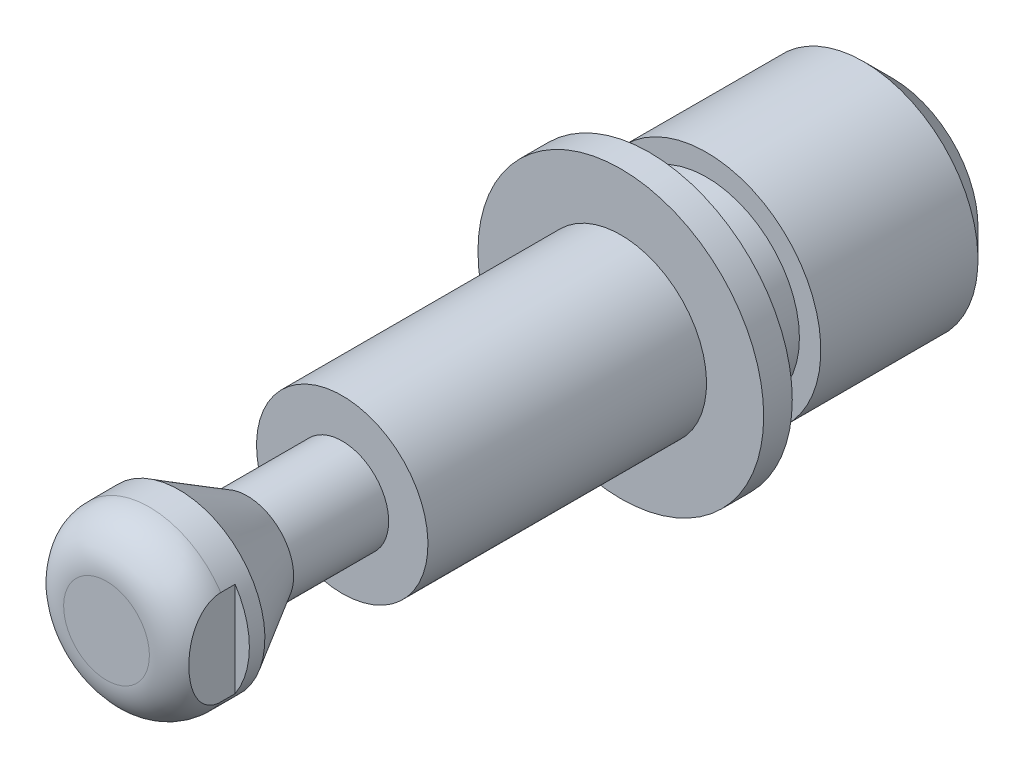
ISO-10303-21;
HEADER;
FILE_DESCRIPTION(('STEP AP214'),'2;1');
FILE_NAME('part.step','',(''),(''),'','','');
FILE_SCHEMA(('AUTOMOTIVE_DESIGN { 1 0 10303 214 1 1 1 1 }'));
ENDSEC;
DATA;
#1=APPLICATION_CONTEXT('core data for automotive mechanical design processes');
#2=APPLICATION_PROTOCOL_DEFINITION('international standard','automotive_design',2000,#1);
#3=PRODUCT_CONTEXT('',#1,'mechanical');
#4=PRODUCT('Part','Part','',(#3));
#5=PRODUCT_RELATED_PRODUCT_CATEGORY('part','',(#4));
#6=PRODUCT_DEFINITION_FORMATION('','',#4);
#7=PRODUCT_DEFINITION_CONTEXT('part definition',#1,'design');
#8=PRODUCT_DEFINITION('design','',#6,#7);
#9=PRODUCT_DEFINITION_SHAPE('','',#8);
#10=(LENGTH_UNIT() NAMED_UNIT(*) SI_UNIT(.MILLI.,.METRE.));
#11=(NAMED_UNIT(*) PLANE_ANGLE_UNIT() SI_UNIT($,.RADIAN.));
#12=(NAMED_UNIT(*) SI_UNIT($,.STERADIAN.) SOLID_ANGLE_UNIT());
#13=UNCERTAINTY_MEASURE_WITH_UNIT(LENGTH_MEASURE(1.E-05),#10,'distance_accuracy_value','');
#14=(GEOMETRIC_REPRESENTATION_CONTEXT(3) GLOBAL_UNCERTAINTY_ASSIGNED_CONTEXT((#13)) GLOBAL_UNIT_ASSIGNED_CONTEXT((#10,
#11,#12)) REPRESENTATION_CONTEXT('',''));
#15=CARTESIAN_POINT('',(0.,0.,0.));
#16=DIRECTION('',(0.,0.,1.));
#17=DIRECTION('',(1.,0.,0.));
#18=AXIS2_PLACEMENT_3D('',#15,#16,#17);
#19=CARTESIAN_POINT('',(0.,0.,0.));
#20=DIRECTION('',(0.,0.,-1.));
#21=DIRECTION('',(0.,1.,0.));
#22=AXIS2_PLACEMENT_3D('',#19,#20,#21);
#23=PLANE('',#22);
#24=CARTESIAN_POINT('',(0.,0.,0.));
#25=DIRECTION('',(0.,0.,1.));
#26=DIRECTION('',(0.,-1.,0.));
#27=AXIS2_PLACEMENT_3D('',#24,#25,#26);
#28=CIRCLE('',#27,10.);
#29=CARTESIAN_POINT('',(0.,-10.,0.));
#30=VERTEX_POINT('',#29);
#31=EDGE_CURVE('E107',#30,#30,#28,.T.);
#32=ORIENTED_EDGE('',*,*,#31,.F.);
#33=EDGE_LOOP('',(#32));
#34=FACE_BOUND('',#33,.T.);
#35=CARTESIAN_POINT('',(0.,0.,0.));
#36=DIRECTION('',(0.,0.,-1.));
#37=DIRECTION('',(1.,0.,0.));
#38=AXIS2_PLACEMENT_3D('',#35,#36,#37);
#39=CIRCLE('',#38,6.5);
#40=CARTESIAN_POINT('',(6.5,0.,0.));
#41=VERTEX_POINT('',#40);
#42=EDGE_CURVE('E82',#41,#41,#39,.T.);
#43=ORIENTED_EDGE('',*,*,#42,.F.);
#44=EDGE_LOOP('',(#43));
#45=FACE_BOUND('',#44,.T.);
#46=ADVANCED_FACE('F14',(#34,#45),#23,.T.);
#47=CARTESIAN_POINT('',(0.,0.,0.));
#48=DIRECTION('',(0.,0.,1.));
#49=DIRECTION('',(0.,-1.,0.));
#50=AXIS2_PLACEMENT_3D('',#47,#48,#49);
#51=CYLINDRICAL_SURFACE('',#50,10.);
#52=ORIENTED_EDGE('',*,*,#31,.T.);
#53=EDGE_LOOP('',(#52));
#54=FACE_BOUND('',#53,.T.);
#55=CARTESIAN_POINT('',(0.,0.,2.));
#56=DIRECTION('',(0.,0.,1.));
#57=DIRECTION('',(0.,-1.,0.));
#58=AXIS2_PLACEMENT_3D('',#55,#56,#57);
#59=CIRCLE('',#58,10.);
#60=CARTESIAN_POINT('',(0.,-10.,2.));
#61=VERTEX_POINT('',#60);
#62=EDGE_CURVE('E104',#61,#61,#59,.T.);
#63=ORIENTED_EDGE('',*,*,#62,.F.);
#64=EDGE_LOOP('',(#63));
#65=FACE_BOUND('',#64,.T.);
#66=ADVANCED_FACE('F157',(#54,#65),#51,.T.);
#67=CARTESIAN_POINT('',(0.,-10.,2.));
#68=DIRECTION('',(0.,0.,1.));
#69=DIRECTION('',(0.,-1.,0.));
#70=AXIS2_PLACEMENT_3D('',#67,#68,#69);
#71=PLANE('',#70);
#72=ORIENTED_EDGE('',*,*,#62,.T.);
#73=EDGE_LOOP('',(#72));
#74=FACE_BOUND('',#73,.T.);
#75=CARTESIAN_POINT('',(0.,0.,2.));
#76=DIRECTION('',(0.,0.,1.));
#77=DIRECTION('',(0.,-1.,0.));
#78=AXIS2_PLACEMENT_3D('',#75,#76,#77);
#79=CIRCLE('',#78,6.);
#80=CARTESIAN_POINT('',(0.,-6.,2.));
#81=VERTEX_POINT('',#80);
#82=EDGE_CURVE('E101',#81,#81,#79,.T.);
#83=ORIENTED_EDGE('',*,*,#82,.F.);
#84=EDGE_LOOP('',(#83));
#85=FACE_BOUND('',#84,.T.);
#86=ADVANCED_FACE('F163',(#74,#85),#71,.T.);
#87=CARTESIAN_POINT('',(0.,0.,0.));
#88=DIRECTION('',(0.,0.,1.));
#89=DIRECTION('',(0.,-1.,0.));
#90=AXIS2_PLACEMENT_3D('',#87,#88,#89);
#91=CYLINDRICAL_SURFACE('',#90,6.);
#92=ORIENTED_EDGE('',*,*,#82,.T.);
#93=EDGE_LOOP('',(#92));
#94=FACE_BOUND('',#93,.T.);
#95=CARTESIAN_POINT('',(0.,0.,21.5));
#96=DIRECTION('',(0.,0.,1.));
#97=DIRECTION('',(0.,-1.,0.));
#98=AXIS2_PLACEMENT_3D('',#95,#96,#97);
#99=CIRCLE('',#98,6.);
#100=CARTESIAN_POINT('',(0.,-6.,21.5));
#101=VERTEX_POINT('',#100);
#102=EDGE_CURVE('E98',#101,#101,#99,.T.);
#103=ORIENTED_EDGE('',*,*,#102,.F.);
#104=EDGE_LOOP('',(#103));
#105=FACE_BOUND('',#104,.T.);
#106=ADVANCED_FACE('F171',(#94,#105),#91,.T.);
#107=CARTESIAN_POINT('',(0.,-3.25,21.5));
#108=DIRECTION('',(0.,0.,1.));
#109=DIRECTION('',(0.,-1.,0.));
#110=AXIS2_PLACEMENT_3D('',#107,#108,#109);
#111=PLANE('',#110);
#112=ORIENTED_EDGE('',*,*,#102,.T.);
#113=EDGE_LOOP('',(#112));
#114=FACE_BOUND('',#113,.T.);
#115=CARTESIAN_POINT('',(0.,0.,21.5));
#116=DIRECTION('',(0.,0.,1.));
#117=DIRECTION('',(0.,-1.,0.));
#118=AXIS2_PLACEMENT_3D('',#115,#116,#117);
#119=CIRCLE('',#118,3.25);
#120=CARTESIAN_POINT('',(0.,-3.25,21.5));
#121=VERTEX_POINT('',#120);
#122=EDGE_CURVE('E95',#121,#121,#119,.T.);
#123=ORIENTED_EDGE('',*,*,#122,.F.);
#124=EDGE_LOOP('',(#123));
#125=FACE_BOUND('',#124,.T.);
#126=ADVANCED_FACE('F175',(#114,#125),#111,.T.);
#127=CARTESIAN_POINT('',(0.,0.,0.));
#128=DIRECTION('',(0.,0.,1.));
#129=DIRECTION('',(0.,-1.,0.));
#130=AXIS2_PLACEMENT_3D('',#127,#128,#129);
#131=CYLINDRICAL_SURFACE('',#130,3.25);
#132=ORIENTED_EDGE('',*,*,#122,.T.);
#133=EDGE_LOOP('',(#132));
#134=FACE_BOUND('',#133,.T.);
#135=CARTESIAN_POINT('',(0.,0.,28.15));
#136=DIRECTION('',(0.,0.,1.));
#137=DIRECTION('',(0.,-1.,0.));
#138=AXIS2_PLACEMENT_3D('',#135,#136,#137);
#139=CIRCLE('',#138,3.25);
#140=CARTESIAN_POINT('',(0.,-3.25,28.15));
#141=VERTEX_POINT('',#140);
#142=EDGE_CURVE('E92',#141,#141,#139,.T.);
#143=ORIENTED_EDGE('',*,*,#142,.F.);
#144=EDGE_LOOP('',(#143));
#145=FACE_BOUND('',#144,.T.);
#146=ADVANCED_FACE('F179',(#134,#145),#131,.T.);
#147=CARTESIAN_POINT('',(0.,0.,32.9131397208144));
#148=DIRECTION('',(0.,0.,1.));
#149=DIRECTION('',(0.,-1.,0.));
#150=AXIS2_PLACEMENT_3D('',#147,#148,#149);
#151=CONICAL_SURFACE('',#150,6.,0.5235987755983);
#152=ORIENTED_EDGE('',*,*,#142,.T.);
#153=EDGE_LOOP('',(#152));
#154=FACE_BOUND('',#153,.T.);
#155=CARTESIAN_POINT('',(0.,0.,32.9131397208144));
#156=DIRECTION('',(0.,0.,1.));
#157=DIRECTION('',(0.,-1.,0.));
#158=AXIS2_PLACEMENT_3D('',#155,#156,#157);
#159=CIRCLE('',#158,6.);
#160=CARTESIAN_POINT('',(0.,-6.,32.9131397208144));
#161=VERTEX_POINT('',#160);
#162=EDGE_CURVE('E89',#161,#161,#159,.T.);
#163=ORIENTED_EDGE('',*,*,#162,.F.);
#164=EDGE_LOOP('',(#163));
#165=FACE_BOUND('',#164,.T.);
#166=ADVANCED_FACE('F183',(#154,#165),#151,.T.);
#167=CARTESIAN_POINT('',(0.,0.,0.));
#168=DIRECTION('',(0.,0.,1.));
#169=DIRECTION('',(0.,-1.,0.));
#170=AXIS2_PLACEMENT_3D('',#167,#168,#169);
#171=CYLINDRICAL_SURFACE('',#170,6.);
#172=DIRECTION('',(0.,0.,1.));
#173=VECTOR('',#172,1.);
#174=CARTESIAN_POINT('',(5.,-3.31662479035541,0.));
#175=LINE('',#174,#173);
#176=CARTESIAN_POINT('',(5.,-3.31662479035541,35.));
#177=VERTEX_POINT('',#176);
#178=CARTESIAN_POINT('',(5.,-3.31662479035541,34.));
#179=VERTEX_POINT('',#178);
#180=EDGE_CURVE('E64',#177,#179,#175,.F.);
#181=ORIENTED_EDGE('',*,*,#180,.F.);
#182=CARTESIAN_POINT('',(0.,0.,35.));
#183=DIRECTION('',(0.,0.,1.));
#184=DIRECTION('',(0.,-1.,0.));
#185=AXIS2_PLACEMENT_3D('',#182,#183,#184);
#186=CIRCLE('',#185,6.);
#187=CARTESIAN_POINT('',(-5.,-3.31662479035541,35.));
#188=VERTEX_POINT('',#187);
#189=EDGE_CURVE('E37',#177,#188,#186,.F.);
#190=ORIENTED_EDGE('',*,*,#189,.T.);
#191=DIRECTION('',(0.,0.,1.));
#192=VECTOR('',#191,1.);
#193=CARTESIAN_POINT('',(-5.,-3.31662479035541,0.));
#194=LINE('',#193,#192);
#195=CARTESIAN_POINT('',(-5.,-3.31662479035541,34.));
#196=VERTEX_POINT('',#195);
#197=EDGE_CURVE('E78',#196,#188,#194,.T.);
#198=ORIENTED_EDGE('',*,*,#197,.F.);
#199=CARTESIAN_POINT('',(0.,0.,34.));
#200=DIRECTION('',(0.,0.,-1.));
#201=DIRECTION('',(1.,0.,0.));
#202=AXIS2_PLACEMENT_3D('',#199,#200,#201);
#203=CIRCLE('',#202,6.);
#204=CARTESIAN_POINT('',(-5.,3.31662479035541,34.));
#205=VERTEX_POINT('',#204);
#206=EDGE_CURVE('E123',#205,#196,#203,.F.);
#207=ORIENTED_EDGE('',*,*,#206,.F.);
#208=DIRECTION('',(0.,0.,1.));
#209=VECTOR('',#208,1.);
#210=CARTESIAN_POINT('',(-5.,3.31662479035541,0.));
#211=LINE('',#210,#209);
#212=CARTESIAN_POINT('',(-5.,3.31662479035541,35.));
#213=VERTEX_POINT('',#212);
#214=EDGE_CURVE('E80',#213,#205,#211,.F.);
#215=ORIENTED_EDGE('',*,*,#214,.F.);
#216=CARTESIAN_POINT('',(5.,3.31662479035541,35.));
#217=VERTEX_POINT('',#216);
#218=EDGE_CURVE('E71',#213,#217,#186,.F.);
#219=ORIENTED_EDGE('',*,*,#218,.T.);
#220=DIRECTION('',(0.,0.,1.));
#221=VECTOR('',#220,1.);
#222=CARTESIAN_POINT('',(5.,3.31662479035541,0.));
#223=LINE('',#222,#221);
#224=CARTESIAN_POINT('',(5.,3.31662479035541,34.));
#225=VERTEX_POINT('',#224);
#226=EDGE_CURVE('E29',#225,#217,#223,.T.);
#227=ORIENTED_EDGE('',*,*,#226,.F.);
#228=CARTESIAN_POINT('',(0.,0.,34.));
#229=DIRECTION('',(0.,0.,-1.));
#230=DIRECTION('',(1.,0.,0.));
#231=AXIS2_PLACEMENT_3D('',#228,#229,#230);
#232=CIRCLE('',#231,6.);
#233=EDGE_CURVE('E58',#179,#225,#232,.F.);
#234=ORIENTED_EDGE('',*,*,#233,.F.);
#235=EDGE_LOOP('',(#181,#190,#198,#207,#215,#219,#227,#234));
#236=FACE_BOUND('',#235,.T.);
#237=ORIENTED_EDGE('',*,*,#162,.T.);
#238=EDGE_LOOP('',(#237));
#239=FACE_BOUND('',#238,.T.);
#240=ADVANCED_FACE('F67',(#236,#239),#171,.T.);
#241=CARTESIAN_POINT('',(0.,0.,38.));
#242=DIRECTION('',(0.,0.,1.));
#243=DIRECTION('',(0.,-1.,0.));
#244=AXIS2_PLACEMENT_3D('',#241,#242,#243);
#245=PLANE('',#244);
#246=CARTESIAN_POINT('',(0.,0.,38.));
#247=DIRECTION('',(0.,0.,1.));
#248=DIRECTION('',(0.,-1.,0.));
#249=AXIS2_PLACEMENT_3D('',#246,#247,#248);
#250=CIRCLE('',#249,3.);
#251=CARTESIAN_POINT('',(0.,-3.,38.));
#252=VERTEX_POINT('',#251);
#253=EDGE_CURVE('E110',#252,#252,#250,.T.);
#254=ORIENTED_EDGE('',*,*,#253,.T.);
#255=EDGE_LOOP('',(#254));
#256=FACE_BOUND('',#255,.T.);
#257=ADVANCED_FACE('F189',(#256),#245,.T.);
#258=CARTESIAN_POINT('',(0.,0.,35.));
#259=DIRECTION('',(0.,0.,1.));
#260=DIRECTION('',(0.,-1.,0.));
#261=AXIS2_PLACEMENT_3D('',#258,#259,#260);
#262=DEGENERATE_TOROIDAL_SURFACE('',#261,3.,3.,.T.);
#263=CARTESIAN_POINT('',(5.,0.,37.2360679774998));
#264=CARTESIAN_POINT('',(5.,-0.120918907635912,37.2360654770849));
#265=CARTESIAN_POINT('',(5.,-0.241827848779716,37.2321569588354));
#266=CARTESIAN_POINT('',(5.,-0.483117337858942,37.2163673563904));
#267=CARTESIAN_POINT('',(5.,-0.603497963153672,37.204487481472));
#268=CARTESIAN_POINT('',(5.,-0.843175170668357,37.172309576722));
#269=CARTESIAN_POINT('',(5.,-0.962471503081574,37.1520096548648));
#270=CARTESIAN_POINT('',(5.,-1.19911813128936,37.1022831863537));
#271=CARTESIAN_POINT('',(5.,-1.31646901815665,37.0728594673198));
#272=CARTESIAN_POINT('',(5.,-1.59010251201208,36.9914925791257));
#273=CARTESIAN_POINT('',(5.,-1.74515200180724,36.9352545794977));
#274=CARTESIAN_POINT('',(5.,-2.0457254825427,36.8013699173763));
#275=CARTESIAN_POINT('',(5.,-2.19126336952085,36.7237553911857));
#276=CARTESIAN_POINT('',(5.,-2.43890308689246,36.5627711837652));
#277=CARTESIAN_POINT('',(5.,-2.54382254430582,36.4837739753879));
#278=CARTESIAN_POINT('',(5.,-2.7396282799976,36.3098769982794));
#279=CARTESIAN_POINT('',(5.,-2.83053188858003,36.214997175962));
#280=CARTESIAN_POINT('',(5.,-2.97723052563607,36.0301159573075));
#281=CARTESIAN_POINT('',(5.,-3.03641451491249,35.942813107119));
#282=CARTESIAN_POINT('',(5.,-3.13957828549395,35.7595839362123));
#283=CARTESIAN_POINT('',(5.,-3.18356514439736,35.6636616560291));
#284=CARTESIAN_POINT('',(5.,-3.25393965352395,35.4648474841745));
#285=CARTESIAN_POINT('',(5.,-3.28022077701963,35.3619174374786));
#286=CARTESIAN_POINT('',(5.,-3.31290834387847,35.1529411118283));
#287=CARTESIAN_POINT('',(5.,-3.31932342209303,35.0468962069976));
#288=CARTESIAN_POINT('',(5.,-3.31222176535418,34.8462659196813));
#289=CARTESIAN_POINT('',(5.,-3.30065386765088,34.7516055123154));
#290=CARTESIAN_POINT('',(5.,-3.26181910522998,34.5655953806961));
#291=CARTESIAN_POINT('',(5.,-3.23455371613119,34.4742453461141));
#292=CARTESIAN_POINT('',(5.,-3.16568011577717,34.2967666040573));
#293=CARTESIAN_POINT('',(5.,-3.12401645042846,34.2106596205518));
#294=CARTESIAN_POINT('',(5.,-3.02836892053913,34.0456244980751));
#295=CARTESIAN_POINT('',(5.,-2.97437928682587,33.9666997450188));
#296=CARTESIAN_POINT('',(5.,-2.83319578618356,33.7878200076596));
#297=CARTESIAN_POINT('',(5.,-2.74125094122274,33.6916074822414));
#298=CARTESIAN_POINT('',(5.,-2.54296994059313,33.5154254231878));
#299=CARTESIAN_POINT('',(5.,-2.43660860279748,33.4354849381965));
#300=CARTESIAN_POINT('',(5.,-2.16830650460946,33.2616870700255));
#301=CARTESIAN_POINT('',(5.,-2.00142235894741,33.1755042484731));
#302=CARTESIAN_POINT('',(5.,-1.65626349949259,33.0302057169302));
#303=CARTESIAN_POINT('',(5.,-1.47796334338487,32.9711530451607));
#304=CARTESIAN_POINT('',(5.,-1.15914275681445,32.8876929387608));
#305=CARTESIAN_POINT('',(5.,-1.01985771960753,32.8583678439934));
#306=CARTESIAN_POINT('',(5.,-0.739223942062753,32.8117236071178));
#307=CARTESIAN_POINT('',(5.,-0.597874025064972,32.7944116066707));
#308=CARTESIAN_POINT('',(5.,-0.314037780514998,32.7709143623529));
#309=CARTESIAN_POINT('',(5.,-0.171549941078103,32.7647478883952));
#310=CARTESIAN_POINT('',(5.,0.113440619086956,32.7632671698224));
#311=CARTESIAN_POINT('',(5.,0.255943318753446,32.7679492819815));
#312=CARTESIAN_POINT('',(5.,0.518018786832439,32.7868218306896));
#313=CARTESIAN_POINT('',(5.,0.637707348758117,32.7994184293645));
#314=CARTESIAN_POINT('',(5.,0.875936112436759,32.8330000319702));
#315=CARTESIAN_POINT('',(5.,0.994476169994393,32.8539860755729));
#316=CARTESIAN_POINT('',(5.,1.22924960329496,32.9049977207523));
#317=CARTESIAN_POINT('',(5.,1.34548886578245,32.9349958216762));
#318=CARTESIAN_POINT('',(5.,1.57487815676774,33.0049676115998));
#319=CARTESIAN_POINT('',(5.,1.68802992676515,33.0449355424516));
#320=CARTESIAN_POINT('',(5.,1.93726711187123,33.1471729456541));
#321=CARTESIAN_POINT('',(5.,2.07212579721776,33.2125115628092));
#322=CARTESIAN_POINT('',(5.,2.33077391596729,33.3624490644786));
#323=CARTESIAN_POINT('',(5.,2.45457463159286,33.4470279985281));
#324=CARTESIAN_POINT('',(5.,2.66253632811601,33.6179675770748));
#325=CARTESIAN_POINT('',(5.,2.74969244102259,33.7006594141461));
#326=CARTESIAN_POINT('',(5.,2.90941931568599,33.8791550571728));
#327=CARTESIAN_POINT('',(5.,2.98200679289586,33.9749436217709));
#328=CARTESIAN_POINT('',(5.,3.0982354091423,34.1618145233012));
#329=CARTESIAN_POINT('',(5.,3.14465751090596,34.2511615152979));
#330=CARTESIAN_POINT('',(5.,3.22195881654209,34.4363821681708));
#331=CARTESIAN_POINT('',(5.,3.25284467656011,34.5322530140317));
#332=CARTESIAN_POINT('',(5.,3.29731276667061,34.7283734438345));
#333=CARTESIAN_POINT('',(5.,3.31082509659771,34.8286390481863));
#334=CARTESIAN_POINT('',(5.,3.31940920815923,35.0299567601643));
#335=CARTESIAN_POINT('',(5.,3.31448404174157,35.1310087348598));
#336=CARTESIAN_POINT('',(5.,3.28751634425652,35.3236265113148));
#337=CARTESIAN_POINT('',(5.,3.26668052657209,35.4153652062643));
#338=CARTESIAN_POINT('',(5.,3.21051142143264,35.5942547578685));
#339=CARTESIAN_POINT('',(5.,3.17517729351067,35.6814053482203));
#340=CARTESIAN_POINT('',(5.,3.08996682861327,35.8529027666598));
#341=CARTESIAN_POINT('',(5.,3.03953428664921,35.9369712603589));
#342=CARTESIAN_POINT('',(5.,2.92708168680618,36.0969044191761));
#343=CARTESIAN_POINT('',(5.,2.86505640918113,36.1727653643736));
#344=CARTESIAN_POINT('',(5.,2.70091379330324,36.3486262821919));
#345=CARTESIAN_POINT('',(5.,2.59347912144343,36.4436767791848));
#346=CARTESIAN_POINT('',(5.,2.36468756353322,36.6152304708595));
#347=CARTESIAN_POINT('',(5.,2.24329783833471,36.6916885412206));
#348=CARTESIAN_POINT('',(5.,1.93419060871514,36.8581380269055));
#349=CARTESIAN_POINT('',(5.,1.74132926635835,36.9385798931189));
#350=CARTESIAN_POINT('',(5.,1.44490972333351,37.0360436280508));
#351=CARTESIAN_POINT('',(5.,1.34482286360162,37.0646801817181));
#352=CARTESIAN_POINT('',(5.,1.14288449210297,37.1148876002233));
#353=CARTESIAN_POINT('',(5.,1.04103334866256,37.1364599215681));
#354=CARTESIAN_POINT('',(5.,0.783859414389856,37.1824311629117));
#355=CARTESIAN_POINT('',(5.,0.62778968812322,37.2026484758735));
#356=CARTESIAN_POINT('',(5.,0.314474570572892,37.2294704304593));
#357=CARTESIAN_POINT('',(5.,0.15722885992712,37.2360712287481));
#358=CARTESIAN_POINT('',(5.,0.,37.2360679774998));
#359=B_SPLINE_CURVE_WITH_KNOTS('',3,(#263,#264,#265,#266,#267,#268,#269,#270,#271,#272,#273,
#274,#275,#276,#277,#278,#279,#280,#281,#282,#283,#284,#285,#286,#287,#288,#289,#290,#291,#292,
#293,#294,#295,#296,#297,#298,#299,#300,#301,#302,#303,#304,#305,#306,#307,#308,#309,#310,#311,
#312,#313,#314,#315,#316,#317,#318,#319,#320,#321,#322,#323,#324,#325,#326,#327,#328,#329,#330,
#331,#332,#333,#334,#335,#336,#337,#338,#339,#340,#341,#342,#343,#344,#345,#346,#347,#348,#349,
#350,#351,#352,#353,#354,#355,#356,#357,#358),.UNSPECIFIED.,.T.,.F.,(4,2,2,2,2,2,2,2,2,2,2,2,2,
2,2,2,2,2,2,2,2,2,2,2,2,2,2,2,2,2,2,2,2,2,2,2,2,2,2,2,2,2,2,2,2,2,2,4),(0.,0.362673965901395,
0.725292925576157,1.08799341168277,1.45058160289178,1.94401806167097,2.43671672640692,
2.8293214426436,3.22143674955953,3.53657847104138,3.85157322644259,4.16844661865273,
4.48518226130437,4.76990781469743,5.05460660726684,5.34041435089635,5.62635614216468,
6.02338925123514,6.4211250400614,6.98148877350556,7.54314803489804,7.96962891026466,
8.39636310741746,8.82381529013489,9.25112394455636,9.61190509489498,9.97273096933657,
10.332466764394,10.6919952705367,11.1401969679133,11.5879360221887,11.9470202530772,
12.3056901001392,12.6064755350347,12.9071319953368,13.2089943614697,13.5108067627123,
13.7917573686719,14.072724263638,14.3656805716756,14.6587691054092,15.0866864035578,
15.515632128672,16.1388153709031,16.4509640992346,16.7630484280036,17.2344943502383,
17.7060733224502),.UNSPECIFIED.);
#360=EDGE_CURVE('E61',#217,#177,#359,.T.);
#361=ORIENTED_EDGE('',*,*,#360,.F.);
#362=ORIENTED_EDGE('',*,*,#218,.F.);
#363=CARTESIAN_POINT('',(-5.,0.,37.2360679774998));
#364=CARTESIAN_POINT('',(-5.,0.12091890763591,37.2360654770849));
#365=CARTESIAN_POINT('',(-5.,0.241827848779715,37.2321569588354));
#366=CARTESIAN_POINT('',(-5.,0.483117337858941,37.2163673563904));
#367=CARTESIAN_POINT('',(-5.,0.603497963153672,37.204487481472));
#368=CARTESIAN_POINT('',(-5.,0.843175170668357,37.172309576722));
#369=CARTESIAN_POINT('',(-5.,0.962471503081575,37.1520096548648));
#370=CARTESIAN_POINT('',(-5.,1.19911813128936,37.1022831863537));
#371=CARTESIAN_POINT('',(-5.,1.31646901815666,37.0728594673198));
#372=CARTESIAN_POINT('',(-5.,1.59010251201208,36.9914925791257));
#373=CARTESIAN_POINT('',(-5.,1.74515200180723,36.9352545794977));
#374=CARTESIAN_POINT('',(-5.,2.0457254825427,36.8013699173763));
#375=CARTESIAN_POINT('',(-5.,2.19126336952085,36.7237553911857));
#376=CARTESIAN_POINT('',(-5.,2.43890308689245,36.5627711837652));
#377=CARTESIAN_POINT('',(-5.,2.54382254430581,36.4837739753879));
#378=CARTESIAN_POINT('',(-5.,2.73962827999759,36.3098769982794));
#379=CARTESIAN_POINT('',(-5.,2.83053188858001,36.214997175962));
#380=CARTESIAN_POINT('',(-5.,2.97723052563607,36.0301159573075));
#381=CARTESIAN_POINT('',(-5.,3.03641451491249,35.942813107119));
#382=CARTESIAN_POINT('',(-5.,3.13957828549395,35.7595839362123));
#383=CARTESIAN_POINT('',(-5.,3.18356514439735,35.6636616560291));
#384=CARTESIAN_POINT('',(-5.,3.25393965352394,35.4648474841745));
#385=CARTESIAN_POINT('',(-5.,3.28022077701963,35.3619174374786));
#386=CARTESIAN_POINT('',(-5.,3.31290834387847,35.1529411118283));
#387=CARTESIAN_POINT('',(-5.,3.31932342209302,35.0468962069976));
#388=CARTESIAN_POINT('',(-5.,3.31222176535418,34.8462659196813));
#389=CARTESIAN_POINT('',(-5.,3.30065386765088,34.7516055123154));
#390=CARTESIAN_POINT('',(-5.,3.26181910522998,34.5655953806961));
#391=CARTESIAN_POINT('',(-5.,3.23455371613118,34.4742453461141));
#392=CARTESIAN_POINT('',(-5.,3.16568011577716,34.2967666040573));
#393=CARTESIAN_POINT('',(-5.,3.12401645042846,34.2106596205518));
#394=CARTESIAN_POINT('',(-5.,3.02836892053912,34.0456244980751));
#395=CARTESIAN_POINT('',(-5.,2.97437928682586,33.9666997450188));
#396=CARTESIAN_POINT('',(-5.,2.83319578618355,33.7878200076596));
#397=CARTESIAN_POINT('',(-5.,2.74125094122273,33.6916074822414));
#398=CARTESIAN_POINT('',(-5.,2.54296994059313,33.5154254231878));
#399=CARTESIAN_POINT('',(-5.,2.43660860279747,33.4354849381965));
#400=CARTESIAN_POINT('',(-5.,2.16830650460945,33.2616870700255));
#401=CARTESIAN_POINT('',(-5.,2.0014223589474,33.1755042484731));
#402=CARTESIAN_POINT('',(-5.,1.65626349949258,33.0302057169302));
#403=CARTESIAN_POINT('',(-5.,1.47796334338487,32.9711530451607));
#404=CARTESIAN_POINT('',(-5.,1.15914275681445,32.8876929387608));
#405=CARTESIAN_POINT('',(-5.,1.01985771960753,32.8583678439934));
#406=CARTESIAN_POINT('',(-5.,0.739223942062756,32.8117236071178));
#407=CARTESIAN_POINT('',(-5.,0.597874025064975,32.7944116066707));
#408=CARTESIAN_POINT('',(-5.,0.314037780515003,32.7709143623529));
#409=CARTESIAN_POINT('',(-5.,0.17154994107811,32.7647478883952));
#410=CARTESIAN_POINT('',(-5.,-0.113440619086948,32.7632671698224));
#411=CARTESIAN_POINT('',(-5.,-0.255943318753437,32.7679492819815));
#412=CARTESIAN_POINT('',(-5.,-0.518018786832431,32.7868218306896));
#413=CARTESIAN_POINT('',(-5.,-0.63770734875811,32.7994184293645));
#414=CARTESIAN_POINT('',(-5.,-0.875936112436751,32.8330000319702));
#415=CARTESIAN_POINT('',(-5.,-0.994476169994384,32.8539860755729));
#416=CARTESIAN_POINT('',(-5.,-1.22924960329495,32.9049977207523));
#417=CARTESIAN_POINT('',(-5.,-1.34548886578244,32.9349958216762));
#418=CARTESIAN_POINT('',(-5.,-1.57487815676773,33.0049676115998));
#419=CARTESIAN_POINT('',(-5.,-1.68802992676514,33.0449355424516));
#420=CARTESIAN_POINT('',(-5.,-1.93726711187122,33.1471729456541));
#421=CARTESIAN_POINT('',(-5.,-2.07212579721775,33.2125115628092));
#422=CARTESIAN_POINT('',(-5.,-2.33077391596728,33.3624490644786));
#423=CARTESIAN_POINT('',(-5.,-2.45457463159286,33.4470279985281));
#424=CARTESIAN_POINT('',(-5.,-2.66253632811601,33.6179675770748));
#425=CARTESIAN_POINT('',(-5.,-2.74969244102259,33.7006594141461));
#426=CARTESIAN_POINT('',(-5.,-2.90941931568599,33.8791550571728));
#427=CARTESIAN_POINT('',(-5.,-2.98200679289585,33.9749436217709));
#428=CARTESIAN_POINT('',(-5.,-3.0982354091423,34.1618145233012));
#429=CARTESIAN_POINT('',(-5.,-3.14465751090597,34.2511615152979));
#430=CARTESIAN_POINT('',(-5.,-3.2219588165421,34.4363821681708));
#431=CARTESIAN_POINT('',(-5.,-3.2528446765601,34.5322530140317));
#432=CARTESIAN_POINT('',(-5.,-3.2973127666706,34.7283734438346));
#433=CARTESIAN_POINT('',(-5.,-3.31082509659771,34.8286390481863));
#434=CARTESIAN_POINT('',(-5.,-3.31940920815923,35.0299567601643));
#435=CARTESIAN_POINT('',(-5.,-3.31448404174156,35.1310087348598));
#436=CARTESIAN_POINT('',(-5.,-3.28751634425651,35.3236265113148));
#437=CARTESIAN_POINT('',(-5.,-3.26668052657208,35.4153652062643));
#438=CARTESIAN_POINT('',(-5.,-3.21051142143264,35.5942547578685));
#439=CARTESIAN_POINT('',(-5.,-3.17517729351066,35.6814053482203));
#440=CARTESIAN_POINT('',(-5.,-3.08996682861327,35.8529027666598));
#441=CARTESIAN_POINT('',(-5.,-3.03953428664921,35.9369712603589));
#442=CARTESIAN_POINT('',(-5.,-2.92708168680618,36.0969044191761));
#443=CARTESIAN_POINT('',(-5.,-2.86505640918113,36.1727653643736));
#444=CARTESIAN_POINT('',(-5.,-2.70091379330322,36.3486262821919));
#445=CARTESIAN_POINT('',(-5.,-2.59347912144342,36.4436767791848));
#446=CARTESIAN_POINT('',(-5.,-2.36468756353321,36.6152304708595));
#447=CARTESIAN_POINT('',(-5.,-2.2432978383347,36.6916885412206));
#448=CARTESIAN_POINT('',(-5.,-1.93419060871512,36.8581380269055));
#449=CARTESIAN_POINT('',(-5.,-1.74132926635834,36.9385798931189));
#450=CARTESIAN_POINT('',(-5.,-1.44490972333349,37.0360436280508));
#451=CARTESIAN_POINT('',(-5.,-1.3448228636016,37.0646801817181));
#452=CARTESIAN_POINT('',(-5.,-1.14288449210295,37.1148876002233));
#453=CARTESIAN_POINT('',(-5.,-1.04103334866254,37.1364599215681));
#454=CARTESIAN_POINT('',(-5.,-0.78385941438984,37.1824311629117));
#455=CARTESIAN_POINT('',(-5.,-0.62778968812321,37.2026484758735));
#456=CARTESIAN_POINT('',(-5.,-0.314474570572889,37.2294704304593));
#457=CARTESIAN_POINT('',(-5.,-0.157228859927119,37.2360712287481));
#458=CARTESIAN_POINT('',(-5.,0.,37.2360679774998));
#459=B_SPLINE_CURVE_WITH_KNOTS('',3,(#363,#364,#365,#366,#367,#368,#369,#370,#371,#372,#373,
#374,#375,#376,#377,#378,#379,#380,#381,#382,#383,#384,#385,#386,#387,#388,#389,#390,#391,#392,
#393,#394,#395,#396,#397,#398,#399,#400,#401,#402,#403,#404,#405,#406,#407,#408,#409,#410,#411,
#412,#413,#414,#415,#416,#417,#418,#419,#420,#421,#422,#423,#424,#425,#426,#427,#428,#429,#430,
#431,#432,#433,#434,#435,#436,#437,#438,#439,#440,#441,#442,#443,#444,#445,#446,#447,#448,#449,
#450,#451,#452,#453,#454,#455,#456,#457,#458),.UNSPECIFIED.,.T.,.F.,(4,2,2,2,2,2,2,2,2,2,2,2,2,
2,2,2,2,2,2,2,2,2,2,2,2,2,2,2,2,2,2,2,2,2,2,2,2,2,2,2,2,2,2,2,2,2,2,4),(0.,0.362673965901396,
0.725292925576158,1.08799341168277,1.45058160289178,1.94401806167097,2.43671672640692,
2.82932144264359,3.22143674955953,3.53657847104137,3.85157322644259,4.16844661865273,
4.48518226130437,4.76990781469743,5.05460660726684,5.34041435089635,5.62635614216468,
6.02338925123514,6.42112504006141,6.98148877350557,7.54314803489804,7.96962891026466,
8.39636310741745,8.82381529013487,9.25112394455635,9.61190509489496,9.97273096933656,
10.332466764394,10.6919952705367,11.1401969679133,11.5879360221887,11.9470202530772,
12.3056901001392,12.6064755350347,12.9071319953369,13.2089943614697,13.5108067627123,
13.7917573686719,14.072724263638,14.3656805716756,14.6587691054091,15.0866864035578,
15.515632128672,16.1388153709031,16.4509640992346,16.7630484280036,17.2344943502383,
17.7060733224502),.UNSPECIFIED.);
#460=EDGE_CURVE('E114',#188,#213,#459,.T.);
#461=ORIENTED_EDGE('',*,*,#460,.F.);
#462=ORIENTED_EDGE('',*,*,#189,.F.);
#463=EDGE_LOOP('',(#361,#362,#461,#462));
#464=FACE_BOUND('',#463,.T.);
#465=ORIENTED_EDGE('',*,*,#253,.F.);
#466=EDGE_LOOP('',(#465));
#467=FACE_BOUND('',#466,.T.);
#468=ADVANCED_FACE('F125',(#464,#467),#262,.T.);
#469=CARTESIAN_POINT('',(0.,-6.5,-4.));
#470=DIRECTION('',(0.,0.,1.));
#471=DIRECTION('',(-1.,0.,0.));
#472=AXIS2_PLACEMENT_3D('',#469,#470,#471);
#473=PLANE('',#472);
#474=CARTESIAN_POINT('',(0.,0.,-4.));
#475=DIRECTION('',(0.,0.,-1.));
#476=DIRECTION('',(1.,0.,0.));
#477=AXIS2_PLACEMENT_3D('',#474,#475,#476);
#478=CIRCLE('',#477,6.5);
#479=CARTESIAN_POINT('',(6.5,0.,-4.));
#480=VERTEX_POINT('',#479);
#481=EDGE_CURVE('E85',#480,#480,#478,.T.);
#482=ORIENTED_EDGE('',*,*,#481,.T.);
#483=EDGE_LOOP('',(#482));
#484=FACE_BOUND('',#483,.T.);
#485=CARTESIAN_POINT('',(0.,0.,-4.));
#486=DIRECTION('',(0.,0.,1.));
#487=DIRECTION('',(-1.,0.,0.));
#488=AXIS2_PLACEMENT_3D('',#485,#486,#487);
#489=CIRCLE('',#488,8.);
#490=CARTESIAN_POINT('',(-8.,0.,-4.));
#491=VERTEX_POINT('',#490);
#492=EDGE_CURVE('E88',#491,#491,#489,.T.);
#493=ORIENTED_EDGE('',*,*,#492,.T.);
#494=EDGE_LOOP('',(#493));
#495=FACE_BOUND('',#494,.T.);
#496=ADVANCED_FACE('F142',(#484,#495),#473,.T.);
#497=CARTESIAN_POINT('',(0.,0.,-4.66905042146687));
#498=DIRECTION('',(0.,0.,-1.));
#499=DIRECTION('',(1.,0.,0.));
#500=AXIS2_PLACEMENT_3D('',#497,#498,#499);
#501=CYLINDRICAL_SURFACE('',#500,6.5);
#502=ORIENTED_EDGE('',*,*,#42,.T.);
#503=EDGE_LOOP('',(#502));
#504=FACE_BOUND('',#503,.T.);
#505=ORIENTED_EDGE('',*,*,#481,.F.);
#506=EDGE_LOOP('',(#505));
#507=FACE_BOUND('',#506,.T.);
#508=ADVANCED_FACE('F138',(#504,#507),#501,.T.);
#509=CARTESIAN_POINT('',(0.,0.,-17.));
#510=DIRECTION('',(0.,0.,-1.));
#511=DIRECTION('',(0.,1.,0.));
#512=AXIS2_PLACEMENT_3D('',#509,#510,#511);
#513=PLANE('',#512);
#514=CARTESIAN_POINT('',(0.,0.,-17.));
#515=DIRECTION('',(0.,0.,-1.));
#516=DIRECTION('',(0.,1.,0.));
#517=AXIS2_PLACEMENT_3D('',#514,#515,#516);
#518=CIRCLE('',#517,6.);
#519=CARTESIAN_POINT('',(0.,6.,-17.));
#520=VERTEX_POINT('',#519);
#521=EDGE_CURVE('E22',#520,#520,#518,.T.);
#522=ORIENTED_EDGE('',*,*,#521,.T.);
#523=EDGE_LOOP('',(#522));
#524=FACE_BOUND('',#523,.T.);
#525=ADVANCED_FACE('F141',(#524),#513,.T.);
#526=CARTESIAN_POINT('',(0.,0.,-17.));
#527=DIRECTION('',(0.,0.,1.));
#528=DIRECTION('',(0.,-1.,0.));
#529=AXIS2_PLACEMENT_3D('',#526,#527,#528);
#530=CYLINDRICAL_SURFACE('',#529,8.);
#531=CARTESIAN_POINT('',(0.,0.,-15.));
#532=DIRECTION('',(0.,0.,-1.));
#533=DIRECTION('',(0.,1.,0.));
#534=AXIS2_PLACEMENT_3D('',#531,#532,#533);
#535=CIRCLE('',#534,8.);
#536=CARTESIAN_POINT('',(0.,8.,-15.));
#537=VERTEX_POINT('',#536);
#538=EDGE_CURVE('E9',#537,#537,#535,.F.);
#539=ORIENTED_EDGE('',*,*,#538,.T.);
#540=EDGE_LOOP('',(#539));
#541=FACE_BOUND('',#540,.T.);
#542=ORIENTED_EDGE('',*,*,#492,.F.);
#543=EDGE_LOOP('',(#542));
#544=FACE_BOUND('',#543,.T.);
#545=ADVANCED_FACE('F135',(#541,#544),#530,.T.);
#546=CARTESIAN_POINT('',(-5.,21.5,34.));
#547=DIRECTION('',(1.,0.,0.));
#548=DIRECTION('',(0.,0.,1.));
#549=AXIS2_PLACEMENT_3D('',#546,#547,#548);
#550=PLANE('',#549);
#551=ORIENTED_EDGE('',*,*,#214,.T.);
#552=DIRECTION('',(0.,-1.,0.));
#553=VECTOR('',#552,1.);
#554=CARTESIAN_POINT('',(-5.,21.5,34.));
#555=LINE('',#554,#553);
#556=EDGE_CURVE('E73',#205,#196,#555,.T.);
#557=ORIENTED_EDGE('',*,*,#556,.T.);
#558=ORIENTED_EDGE('',*,*,#197,.T.);
#559=ORIENTED_EDGE('',*,*,#460,.T.);
#560=EDGE_LOOP('',(#551,#557,#558,#559));
#561=FACE_BOUND('',#560,.T.);
#562=ADVANCED_FACE('F129',(#561),#550,.F.);
#563=CARTESIAN_POINT('',(-5.,21.5,34.));
#564=DIRECTION('',(0.,0.,-1.));
#565=DIRECTION('',(1.,0.,0.));
#566=AXIS2_PLACEMENT_3D('',#563,#564,#565);
#567=PLANE('',#566);
#568=ORIENTED_EDGE('',*,*,#206,.T.);
#569=ORIENTED_EDGE('',*,*,#556,.F.);
#570=EDGE_LOOP('',(#568,#569));
#571=FACE_BOUND('',#570,.T.);
#572=ADVANCED_FACE('F134',(#571),#567,.F.);
#573=CARTESIAN_POINT('',(5.,21.5,34.));
#574=DIRECTION('',(0.,0.,-1.));
#575=DIRECTION('',(1.,0.,0.));
#576=AXIS2_PLACEMENT_3D('',#573,#574,#575);
#577=PLANE('',#576);
#578=ORIENTED_EDGE('',*,*,#233,.T.);
#579=DIRECTION('',(0.,-1.,0.));
#580=VECTOR('',#579,1.);
#581=CARTESIAN_POINT('',(5.,21.5,34.));
#582=LINE('',#581,#580);
#583=EDGE_CURVE('E60',#225,#179,#582,.T.);
#584=ORIENTED_EDGE('',*,*,#583,.T.);
#585=EDGE_LOOP('',(#578,#584));
#586=FACE_BOUND('',#585,.T.);
#587=ADVANCED_FACE('F59',(#586),#577,.F.);
#588=CARTESIAN_POINT('',(5.,21.5,34.));
#589=DIRECTION('',(-1.,0.,0.));
#590=DIRECTION('',(0.,0.,-1.));
#591=AXIS2_PLACEMENT_3D('',#588,#589,#590);
#592=PLANE('',#591);
#593=ORIENTED_EDGE('',*,*,#180,.T.);
#594=ORIENTED_EDGE('',*,*,#583,.F.);
#595=ORIENTED_EDGE('',*,*,#226,.T.);
#596=ORIENTED_EDGE('',*,*,#360,.T.);
#597=EDGE_LOOP('',(#593,#594,#595,#596));
#598=FACE_BOUND('',#597,.T.);
#599=ADVANCED_FACE('F63',(#598),#592,.F.);
#600=CARTESIAN_POINT('',(0.,0.,-17.));
#601=DIRECTION('',(0.,0.,1.));
#602=DIRECTION('',(0.,-1.,0.));
#603=AXIS2_PLACEMENT_3D('',#600,#601,#602);
#604=CONICAL_SURFACE('',#603,6.,0.785398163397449);
#605=ORIENTED_EDGE('',*,*,#538,.F.);
#606=EDGE_LOOP('',(#605));
#607=FACE_BOUND('',#606,.T.);
#608=ORIENTED_EDGE('',*,*,#521,.F.);
#609=EDGE_LOOP('',(#608));
#610=FACE_BOUND('',#609,.T.);
#611=ADVANCED_FACE('F16',(#607,#610),#604,.T.);
#612=CLOSED_SHELL('',(#46,#66,#86,#106,#126,#146,#166,#240,#257,#468,#496,#508,#525,#545,#562,
#572,#587,#599,#611));
#613=MANIFOLD_SOLID_BREP('B1',#612);
#614=ADVANCED_BREP_SHAPE_REPRESENTATION('',(#18,#613),#14);
#615=SHAPE_DEFINITION_REPRESENTATION(#9,#614);
ENDSEC;
END-ISO-10303-21;
